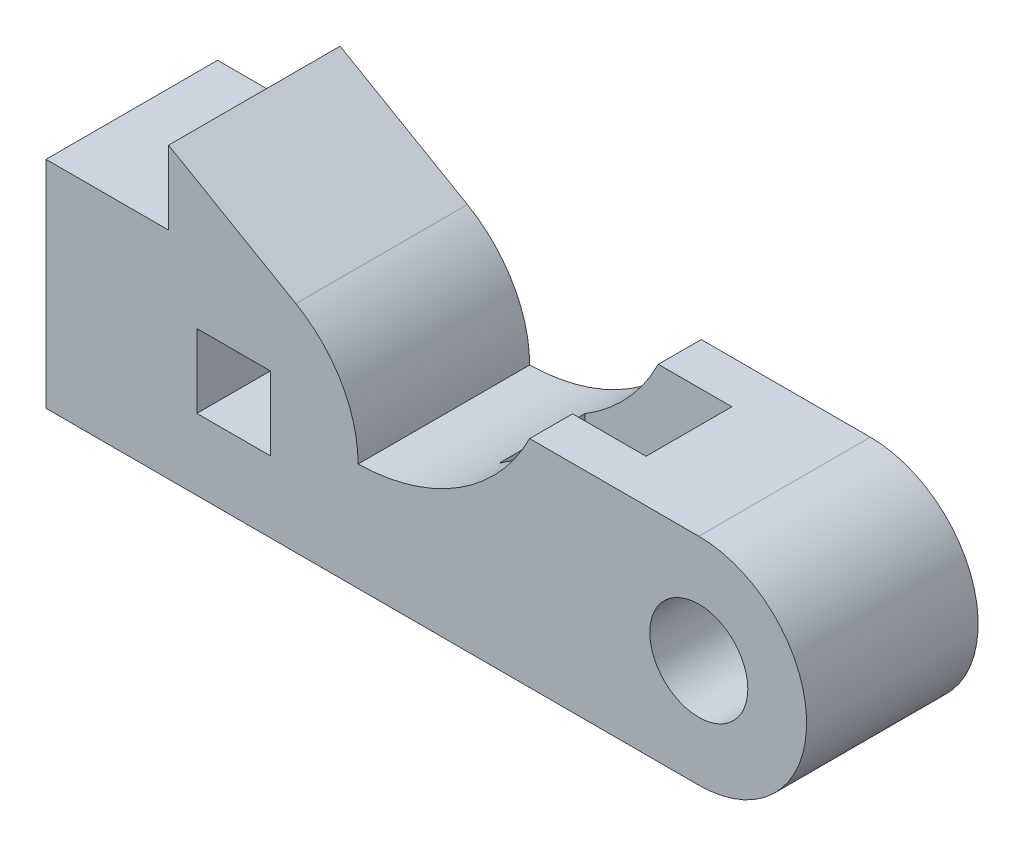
ISO-10303-21;
HEADER;
FILE_DESCRIPTION(('STEP AP214'),'2;1');
FILE_NAME('part.step','',(''),(''),'','','');
FILE_SCHEMA(('AUTOMOTIVE_DESIGN { 1 0 10303 214 1 1 1 1 }'));
ENDSEC;
DATA;
#1=APPLICATION_CONTEXT('core data for automotive mechanical design processes');
#2=APPLICATION_PROTOCOL_DEFINITION('international standard','automotive_design',2000,#1);
#3=PRODUCT_CONTEXT('',#1,'mechanical');
#4=PRODUCT('Part','Part','',(#3));
#5=PRODUCT_RELATED_PRODUCT_CATEGORY('part','',(#4));
#6=PRODUCT_DEFINITION_FORMATION('','',#4);
#7=PRODUCT_DEFINITION_CONTEXT('part definition',#1,'design');
#8=PRODUCT_DEFINITION('design','',#6,#7);
#9=PRODUCT_DEFINITION_SHAPE('','',#8);
#10=(LENGTH_UNIT() NAMED_UNIT(*) SI_UNIT(.MILLI.,.METRE.));
#11=(NAMED_UNIT(*) PLANE_ANGLE_UNIT() SI_UNIT($,.RADIAN.));
#12=(NAMED_UNIT(*) SI_UNIT($,.STERADIAN.) SOLID_ANGLE_UNIT());
#13=UNCERTAINTY_MEASURE_WITH_UNIT(LENGTH_MEASURE(1.E-05),#10,'distance_accuracy_value','');
#14=(GEOMETRIC_REPRESENTATION_CONTEXT(3) GLOBAL_UNCERTAINTY_ASSIGNED_CONTEXT((#13)) GLOBAL_UNIT_ASSIGNED_CONTEXT((#10,
#11,#12)) REPRESENTATION_CONTEXT('',''));
#15=CARTESIAN_POINT('',(0.,0.,0.));
#16=DIRECTION('',(0.,0.,1.));
#17=DIRECTION('',(1.,0.,0.));
#18=AXIS2_PLACEMENT_3D('',#15,#16,#17);
#19=CARTESIAN_POINT('',(76.5581123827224,44.,35.));
#20=DIRECTION('',(0.,0.,-1.));
#21=DIRECTION('',(-1.,0.,0.));
#22=AXIS2_PLACEMENT_3D('',#19,#20,#21);
#23=PLANE('',#22);
#24=CARTESIAN_POINT('',(266.36493607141,44.,35.));
#25=DIRECTION('',(0.,0.,1.));
#26=DIRECTION('',(1.,0.,0.));
#27=AXIS2_PLACEMENT_3D('',#24,#25,#26);
#28=CIRCLE('',#27,20.);
#29=CARTESIAN_POINT('',(286.36493607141,44.,35.));
#30=VERTEX_POINT('',#29);
#31=EDGE_CURVE('E463',#30,#30,#28,.T.);
#32=ORIENTED_EDGE('',*,*,#31,.F.);
#33=EDGE_LOOP('',(#32));
#34=FACE_BOUND('',#33,.T.);
#35=DIRECTION('',(1.,0.,0.));
#36=VECTOR('',#35,1.);
#37=CARTESIAN_POINT('',(266.36493607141,0.,35.));
#38=LINE('',#37,#36);
#39=CARTESIAN_POINT('',(0.,0.,35.));
#40=VERTEX_POINT('',#39);
#41=CARTESIAN_POINT('',(266.36493607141,0.,35.));
#42=VERTEX_POINT('',#41);
#43=EDGE_CURVE('E263',#40,#42,#38,.T.);
#44=ORIENTED_EDGE('',*,*,#43,.T.);
#45=CARTESIAN_POINT('',(266.36493607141,44.,35.));
#46=DIRECTION('',(0.,0.,1.));
#47=DIRECTION('',(-1.,0.,0.));
#48=AXIS2_PLACEMENT_3D('',#45,#46,#47);
#49=CIRCLE('',#48,44.);
#50=CARTESIAN_POINT('',(266.36493607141,88.,35.));
#51=VERTEX_POINT('',#50);
#52=EDGE_CURVE('E267',#42,#51,#49,.T.);
#53=ORIENTED_EDGE('',*,*,#52,.T.);
#54=DIRECTION('',(-1.,0.,0.));
#55=VECTOR('',#54,1.);
#56=CARTESIAN_POINT('',(197.36493607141,88.,35.));
#57=LINE('',#56,#55);
#58=CARTESIAN_POINT('',(197.36493607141,88.,35.));
#59=VERTEX_POINT('',#58);
#60=EDGE_CURVE('E271',#51,#59,#57,.T.);
#61=ORIENTED_EDGE('',*,*,#60,.T.);
#62=CARTESIAN_POINT('',(125.916041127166,123.986878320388,35.));
#63=DIRECTION('',(0.,0.,-1.));
#64=DIRECTION('',(1.,0.,0.));
#65=AXIS2_PLACEMENT_3D('',#62,#63,#64);
#66=CIRCLE('',#65,80.);
#67=CARTESIAN_POINT('',(127.36493607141,44.,35.));
#68=VERTEX_POINT('',#67);
#69=EDGE_CURVE('E274',#59,#68,#66,.T.);
#70=ORIENTED_EDGE('',*,*,#69,.T.);
#71=CARTESIAN_POINT('',(76.5581123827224,44.,35.));
#72=DIRECTION('',(0.,0.,1.));
#73=DIRECTION('',(-1.,0.,0.));
#74=AXIS2_PLACEMENT_3D('',#71,#72,#73);
#75=CIRCLE('',#74,50.8068236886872);
#76=CARTESIAN_POINT('',(101.961524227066,88.,35.));
#77=VERTEX_POINT('',#76);
#78=EDGE_CURVE('E277',#68,#77,#75,.T.);
#79=ORIENTED_EDGE('',*,*,#78,.T.);
#80=DIRECTION('',(-0.866025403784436,0.500000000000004,0.));
#81=VECTOR('',#80,1.);
#82=CARTESIAN_POINT('',(50.,118.,35.));
#83=LINE('',#82,#81);
#84=CARTESIAN_POINT('',(50.,118.,35.));
#85=VERTEX_POINT('',#84);
#86=EDGE_CURVE('E280',#77,#85,#83,.T.);
#87=ORIENTED_EDGE('',*,*,#86,.T.);
#88=DIRECTION('',(0.,-1.,0.));
#89=VECTOR('',#88,1.);
#90=CARTESIAN_POINT('',(50.,88.,35.));
#91=LINE('',#90,#89);
#92=CARTESIAN_POINT('',(50.,88.,35.));
#93=VERTEX_POINT('',#92);
#94=EDGE_CURVE('E283',#85,#93,#91,.T.);
#95=ORIENTED_EDGE('',*,*,#94,.T.);
#96=DIRECTION('',(-1.,0.,0.));
#97=VECTOR('',#96,1.);
#98=CARTESIAN_POINT('',(0.,88.,35.));
#99=LINE('',#98,#97);
#100=CARTESIAN_POINT('',(0.,88.,35.));
#101=VERTEX_POINT('',#100);
#102=EDGE_CURVE('E286',#93,#101,#99,.T.);
#103=ORIENTED_EDGE('',*,*,#102,.T.);
#104=DIRECTION('',(0.,-1.,0.));
#105=VECTOR('',#104,1.);
#106=CARTESIAN_POINT('',(0.,0.,35.));
#107=LINE('',#106,#105);
#108=EDGE_CURVE('E289',#101,#40,#107,.T.);
#109=ORIENTED_EDGE('',*,*,#108,.T.);
#110=EDGE_LOOP('',(#44,#53,#61,#70,#79,#87,#95,#103,#109));
#111=FACE_BOUND('',#110,.T.);
#112=DIRECTION('',(0.,-1.,0.));
#113=VECTOR('',#112,1.);
#114=CARTESIAN_POINT('',(61.5581123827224,29.,35.));
#115=LINE('',#114,#113);
#116=CARTESIAN_POINT('',(61.5581123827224,59.,35.));
#117=VERTEX_POINT('',#116);
#118=CARTESIAN_POINT('',(61.5581123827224,29.,35.));
#119=VERTEX_POINT('',#118);
#120=EDGE_CURVE('E220',#117,#119,#115,.T.);
#121=ORIENTED_EDGE('',*,*,#120,.F.);
#122=DIRECTION('',(-1.,0.,0.));
#123=VECTOR('',#122,1.);
#124=CARTESIAN_POINT('',(91.5581123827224,59.,35.));
#125=LINE('',#124,#123);
#126=CARTESIAN_POINT('',(91.5581123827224,59.,35.));
#127=VERTEX_POINT('',#126);
#128=EDGE_CURVE('E231',#127,#117,#125,.T.);
#129=ORIENTED_EDGE('',*,*,#128,.F.);
#130=DIRECTION('',(0.,1.,0.));
#131=VECTOR('',#130,1.);
#132=CARTESIAN_POINT('',(91.5581123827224,29.,35.));
#133=LINE('',#132,#131);
#134=CARTESIAN_POINT('',(91.5581123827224,29.,35.));
#135=VERTEX_POINT('',#134);
#136=EDGE_CURVE('E227',#135,#127,#133,.T.);
#137=ORIENTED_EDGE('',*,*,#136,.F.);
#138=DIRECTION('',(1.,0.,0.));
#139=VECTOR('',#138,1.);
#140=CARTESIAN_POINT('',(91.5581123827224,29.,35.));
#141=LINE('',#140,#139);
#142=EDGE_CURVE('E223',#119,#135,#141,.T.);
#143=ORIENTED_EDGE('',*,*,#142,.F.);
#144=EDGE_LOOP('',(#121,#129,#137,#143));
#145=FACE_BOUND('',#144,.T.);
#146=ADVANCED_FACE('F45',(#34,#111,#145),#23,.F.);
#147=CARTESIAN_POINT('',(76.5581123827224,44.,-35.));
#148=DIRECTION('',(0.,0.,-1.));
#149=DIRECTION('',(-1.,0.,0.));
#150=AXIS2_PLACEMENT_3D('',#147,#148,#149);
#151=PLANE('',#150);
#152=CARTESIAN_POINT('',(266.36493607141,44.,-35.));
#153=DIRECTION('',(0.,0.,1.));
#154=DIRECTION('',(1.,0.,0.));
#155=AXIS2_PLACEMENT_3D('',#152,#153,#154);
#156=CIRCLE('',#155,20.);
#157=CARTESIAN_POINT('',(286.36493607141,44.,-35.));
#158=VERTEX_POINT('',#157);
#159=EDGE_CURVE('E199',#158,#158,#156,.T.);
#160=ORIENTED_EDGE('',*,*,#159,.T.);
#161=EDGE_LOOP('',(#160));
#162=FACE_BOUND('',#161,.T.);
#163=DIRECTION('',(1.,0.,0.));
#164=VECTOR('',#163,1.);
#165=CARTESIAN_POINT('',(266.36493607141,0.,-35.));
#166=LINE('',#165,#164);
#167=CARTESIAN_POINT('',(0.,0.,-35.));
#168=VERTEX_POINT('',#167);
#169=CARTESIAN_POINT('',(266.36493607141,0.,-35.));
#170=VERTEX_POINT('',#169);
#171=EDGE_CURVE('E262',#168,#170,#166,.T.);
#172=ORIENTED_EDGE('',*,*,#171,.F.);
#173=DIRECTION('',(0.,-1.,0.));
#174=VECTOR('',#173,1.);
#175=CARTESIAN_POINT('',(0.,0.,-35.));
#176=LINE('',#175,#174);
#177=CARTESIAN_POINT('',(0.,88.,-35.));
#178=VERTEX_POINT('',#177);
#179=EDGE_CURVE('E268',#178,#168,#176,.T.);
#180=ORIENTED_EDGE('',*,*,#179,.F.);
#181=DIRECTION('',(-1.,0.,0.));
#182=VECTOR('',#181,1.);
#183=CARTESIAN_POINT('',(0.,88.,-35.));
#184=LINE('',#183,#182);
#185=CARTESIAN_POINT('',(50.,88.,-35.));
#186=VERTEX_POINT('',#185);
#187=EDGE_CURVE('E315',#186,#178,#184,.T.);
#188=ORIENTED_EDGE('',*,*,#187,.F.);
#189=DIRECTION('',(0.,-1.,0.));
#190=VECTOR('',#189,1.);
#191=CARTESIAN_POINT('',(50.,88.,-35.));
#192=LINE('',#191,#190);
#193=CARTESIAN_POINT('',(50.,118.,-35.));
#194=VERTEX_POINT('',#193);
#195=EDGE_CURVE('E312',#194,#186,#192,.T.);
#196=ORIENTED_EDGE('',*,*,#195,.F.);
#197=DIRECTION('',(-0.866025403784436,0.500000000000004,0.));
#198=VECTOR('',#197,1.);
#199=CARTESIAN_POINT('',(50.,118.,-35.));
#200=LINE('',#199,#198);
#201=CARTESIAN_POINT('',(101.961524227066,88.,-35.));
#202=VERTEX_POINT('',#201);
#203=EDGE_CURVE('E309',#202,#194,#200,.T.);
#204=ORIENTED_EDGE('',*,*,#203,.F.);
#205=CARTESIAN_POINT('',(76.5581123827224,44.,-35.));
#206=DIRECTION('',(0.,0.,1.));
#207=DIRECTION('',(-1.,0.,0.));
#208=AXIS2_PLACEMENT_3D('',#205,#206,#207);
#209=CIRCLE('',#208,50.8068236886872);
#210=CARTESIAN_POINT('',(127.36493607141,44.,-35.));
#211=VERTEX_POINT('',#210);
#212=EDGE_CURVE('E306',#211,#202,#209,.T.);
#213=ORIENTED_EDGE('',*,*,#212,.F.);
#214=CARTESIAN_POINT('',(125.916041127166,123.986878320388,-35.));
#215=DIRECTION('',(0.,0.,-1.));
#216=DIRECTION('',(1.,0.,0.));
#217=AXIS2_PLACEMENT_3D('',#214,#215,#216);
#218=CIRCLE('',#217,80.);
#219=CARTESIAN_POINT('',(197.36493607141,88.,-35.));
#220=VERTEX_POINT('',#219);
#221=EDGE_CURVE('E303',#220,#211,#218,.T.);
#222=ORIENTED_EDGE('',*,*,#221,.F.);
#223=DIRECTION('',(-1.,0.,0.));
#224=VECTOR('',#223,1.);
#225=CARTESIAN_POINT('',(197.36493607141,88.,-35.));
#226=LINE('',#225,#224);
#227=CARTESIAN_POINT('',(266.36493607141,88.,-35.));
#228=VERTEX_POINT('',#227);
#229=EDGE_CURVE('E299',#228,#220,#226,.T.);
#230=ORIENTED_EDGE('',*,*,#229,.F.);
#231=CARTESIAN_POINT('',(266.36493607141,44.,-35.));
#232=DIRECTION('',(0.,0.,1.));
#233=DIRECTION('',(-1.,0.,0.));
#234=AXIS2_PLACEMENT_3D('',#231,#232,#233);
#235=CIRCLE('',#234,44.);
#236=EDGE_CURVE('E296',#170,#228,#235,.T.);
#237=ORIENTED_EDGE('',*,*,#236,.F.);
#238=EDGE_LOOP('',(#172,#180,#188,#196,#204,#213,#222,#230,#237));
#239=FACE_BOUND('',#238,.T.);
#240=DIRECTION('',(-1.,0.,0.));
#241=VECTOR('',#240,1.);
#242=CARTESIAN_POINT('',(91.5581123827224,59.,-35.));
#243=LINE('',#242,#241);
#244=CARTESIAN_POINT('',(91.5581123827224,59.,-35.));
#245=VERTEX_POINT('',#244);
#246=CARTESIAN_POINT('',(61.5581123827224,59.,-35.));
#247=VERTEX_POINT('',#246);
#248=EDGE_CURVE('E224',#245,#247,#243,.T.);
#249=ORIENTED_EDGE('',*,*,#248,.T.);
#250=DIRECTION('',(0.,-1.,0.));
#251=VECTOR('',#250,1.);
#252=CARTESIAN_POINT('',(61.5581123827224,29.,-35.));
#253=LINE('',#252,#251);
#254=CARTESIAN_POINT('',(61.5581123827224,29.,-35.));
#255=VERTEX_POINT('',#254);
#256=EDGE_CURVE('E213',#247,#255,#253,.T.);
#257=ORIENTED_EDGE('',*,*,#256,.T.);
#258=DIRECTION('',(1.,0.,0.));
#259=VECTOR('',#258,1.);
#260=CARTESIAN_POINT('',(91.5581123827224,29.,-35.));
#261=LINE('',#260,#259);
#262=CARTESIAN_POINT('',(91.5581123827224,29.,-35.));
#263=VERTEX_POINT('',#262);
#264=EDGE_CURVE('E238',#255,#263,#261,.T.);
#265=ORIENTED_EDGE('',*,*,#264,.T.);
#266=DIRECTION('',(0.,1.,0.));
#267=VECTOR('',#266,1.);
#268=CARTESIAN_POINT('',(91.5581123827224,29.,-35.));
#269=LINE('',#268,#267);
#270=EDGE_CURVE('E242',#263,#245,#269,.T.);
#271=ORIENTED_EDGE('',*,*,#270,.T.);
#272=EDGE_LOOP('',(#249,#257,#265,#271));
#273=FACE_BOUND('',#272,.T.);
#274=ADVANCED_FACE('F383',(#162,#239,#273),#151,.T.);
#275=CARTESIAN_POINT('',(266.36493607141,0.,35.));
#276=DIRECTION('',(0.,1.,0.));
#277=DIRECTION('',(0.,0.,1.));
#278=AXIS2_PLACEMENT_3D('',#275,#276,#277);
#279=PLANE('',#278);
#280=DIRECTION('',(1.,0.,0.));
#281=VECTOR('',#280,1.);
#282=CARTESIAN_POINT('',(167.36493607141,0.,17.5));
#283=LINE('',#282,#281);
#284=CARTESIAN_POINT('',(167.36493607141,0.,17.5));
#285=VERTEX_POINT('',#284);
#286=CARTESIAN_POINT('',(227.36493607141,0.,17.5));
#287=VERTEX_POINT('',#286);
#288=EDGE_CURVE('E183',#285,#287,#283,.T.);
#289=ORIENTED_EDGE('',*,*,#288,.T.);
#290=DIRECTION('',(0.,0.,-1.));
#291=VECTOR('',#290,1.);
#292=CARTESIAN_POINT('',(227.36493607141,0.,17.5));
#293=LINE('',#292,#291);
#294=CARTESIAN_POINT('',(227.36493607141,0.,-17.5));
#295=VERTEX_POINT('',#294);
#296=EDGE_CURVE('E177',#287,#295,#293,.T.);
#297=ORIENTED_EDGE('',*,*,#296,.T.);
#298=DIRECTION('',(-1.,0.,0.));
#299=VECTOR('',#298,1.);
#300=CARTESIAN_POINT('',(167.36493607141,0.,-17.5));
#301=LINE('',#300,#299);
#302=CARTESIAN_POINT('',(167.36493607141,0.,-17.5));
#303=VERTEX_POINT('',#302);
#304=EDGE_CURVE('E186',#295,#303,#301,.T.);
#305=ORIENTED_EDGE('',*,*,#304,.T.);
#306=DIRECTION('',(0.,0.,1.));
#307=VECTOR('',#306,1.);
#308=CARTESIAN_POINT('',(167.36493607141,0.,17.5));
#309=LINE('',#308,#307);
#310=EDGE_CURVE('E61',#303,#285,#309,.T.);
#311=ORIENTED_EDGE('',*,*,#310,.T.);
#312=EDGE_LOOP('',(#289,#297,#305,#311));
#313=FACE_BOUND('',#312,.T.);
#314=ORIENTED_EDGE('',*,*,#171,.T.);
#315=DIRECTION('',(0.,0.,-1.));
#316=VECTOR('',#315,1.);
#317=CARTESIAN_POINT('',(266.36493607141,0.,35.));
#318=LINE('',#317,#316);
#319=EDGE_CURVE('E352',#42,#170,#318,.T.);
#320=ORIENTED_EDGE('',*,*,#319,.F.);
#321=ORIENTED_EDGE('',*,*,#43,.F.);
#322=DIRECTION('',(0.,0.,-1.));
#323=VECTOR('',#322,1.);
#324=CARTESIAN_POINT('',(0.,0.,35.));
#325=LINE('',#324,#323);
#326=EDGE_CURVE('E292',#40,#168,#325,.T.);
#327=ORIENTED_EDGE('',*,*,#326,.T.);
#328=EDGE_LOOP('',(#314,#320,#321,#327));
#329=FACE_BOUND('',#328,.T.);
#330=ADVANCED_FACE('F47',(#313,#329),#279,.F.);
#331=CARTESIAN_POINT('',(266.36493607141,44.,35.));
#332=DIRECTION('',(0.,0.,-1.));
#333=DIRECTION('',(-1.,0.,0.));
#334=AXIS2_PLACEMENT_3D('',#331,#332,#333);
#335=CYLINDRICAL_SURFACE('',#334,44.);
#336=ORIENTED_EDGE('',*,*,#236,.T.);
#337=DIRECTION('',(0.,0.,-1.));
#338=VECTOR('',#337,1.);
#339=CARTESIAN_POINT('',(266.36493607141,88.,35.));
#340=LINE('',#339,#338);
#341=EDGE_CURVE('E348',#51,#228,#340,.T.);
#342=ORIENTED_EDGE('',*,*,#341,.F.);
#343=ORIENTED_EDGE('',*,*,#52,.F.);
#344=ORIENTED_EDGE('',*,*,#319,.T.);
#345=EDGE_LOOP('',(#336,#342,#343,#344));
#346=FACE_BOUND('',#345,.T.);
#347=ADVANCED_FACE('F404',(#346),#335,.T.);
#348=CARTESIAN_POINT('',(197.36493607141,88.,35.));
#349=DIRECTION('',(0.,-1.,0.));
#350=DIRECTION('',(0.,0.,-1.));
#351=AXIS2_PLACEMENT_3D('',#348,#349,#350);
#352=PLANE('',#351);
#353=DIRECTION('',(0.,0.,-1.));
#354=VECTOR('',#353,1.);
#355=CARTESIAN_POINT('',(227.36493607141,88.,17.5));
#356=LINE('',#355,#354);
#357=CARTESIAN_POINT('',(227.36493607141,88.,17.5));
#358=VERTEX_POINT('',#357);
#359=CARTESIAN_POINT('',(227.36493607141,88.,-17.5));
#360=VERTEX_POINT('',#359);
#361=EDGE_CURVE('E180',#358,#360,#356,.T.);
#362=ORIENTED_EDGE('',*,*,#361,.F.);
#363=DIRECTION('',(1.,0.,0.));
#364=VECTOR('',#363,1.);
#365=CARTESIAN_POINT('',(167.36493607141,88.,17.5));
#366=LINE('',#365,#364);
#367=CARTESIAN_POINT('',(197.36493607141,88.,17.5));
#368=VERTEX_POINT('',#367);
#369=EDGE_CURVE('E194',#368,#358,#366,.T.);
#370=ORIENTED_EDGE('',*,*,#369,.F.);
#371=DIRECTION('',(0.,0.,-1.));
#372=VECTOR('',#371,1.);
#373=CARTESIAN_POINT('',(197.36493607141,88.,35.));
#374=LINE('',#373,#372);
#375=EDGE_CURVE('E344',#59,#368,#374,.T.);
#376=ORIENTED_EDGE('',*,*,#375,.F.);
#377=ORIENTED_EDGE('',*,*,#60,.F.);
#378=ORIENTED_EDGE('',*,*,#341,.T.);
#379=ORIENTED_EDGE('',*,*,#229,.T.);
#380=CARTESIAN_POINT('',(197.36493607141,88.,-17.5));
#381=VERTEX_POINT('',#380);
#382=EDGE_CURVE('E343',#381,#220,#374,.T.);
#383=ORIENTED_EDGE('',*,*,#382,.F.);
#384=DIRECTION('',(-1.,0.,0.));
#385=VECTOR('',#384,1.);
#386=CARTESIAN_POINT('',(167.36493607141,88.,-17.5));
#387=LINE('',#386,#385);
#388=EDGE_CURVE('E69',#360,#381,#387,.T.);
#389=ORIENTED_EDGE('',*,*,#388,.F.);
#390=EDGE_LOOP('',(#362,#370,#376,#377,#378,#379,#383,#389));
#391=FACE_BOUND('',#390,.T.);
#392=ADVANCED_FACE('F368',(#391),#352,.F.);
#393=CARTESIAN_POINT('',(125.916041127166,123.986878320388,35.));
#394=DIRECTION('',(0.,0.,-1.));
#395=DIRECTION('',(-1.,0.,0.));
#396=AXIS2_PLACEMENT_3D('',#393,#394,#395);
#397=CYLINDRICAL_SURFACE('',#396,80.);
#398=ORIENTED_EDGE('',*,*,#375,.T.);
#399=CARTESIAN_POINT('',(125.916041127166,123.986878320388,17.5));
#400=DIRECTION('',(0.,0.,1.));
#401=DIRECTION('',(1.,0.,0.));
#402=AXIS2_PLACEMENT_3D('',#399,#400,#401);
#403=CIRCLE('',#402,80.);
#404=CARTESIAN_POINT('',(167.36493607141,55.5618163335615,17.5));
#405=VERTEX_POINT('',#404);
#406=EDGE_CURVE('E11',#368,#405,#403,.F.);
#407=ORIENTED_EDGE('',*,*,#406,.T.);
#408=DIRECTION('',(0.,0.,-1.));
#409=VECTOR('',#408,1.);
#410=CARTESIAN_POINT('',(167.36493607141,55.5618163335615,35.));
#411=LINE('',#410,#409);
#412=CARTESIAN_POINT('',(167.36493607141,55.5618163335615,-17.5));
#413=VERTEX_POINT('',#412);
#414=EDGE_CURVE('E54',#405,#413,#411,.T.);
#415=ORIENTED_EDGE('',*,*,#414,.T.);
#416=CARTESIAN_POINT('',(125.916041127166,123.986878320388,-17.5));
#417=DIRECTION('',(0.,0.,-1.));
#418=DIRECTION('',(-1.,0.,0.));
#419=AXIS2_PLACEMENT_3D('',#416,#417,#418);
#420=CIRCLE('',#419,80.);
#421=EDGE_CURVE('E356',#413,#381,#420,.F.);
#422=ORIENTED_EDGE('',*,*,#421,.T.);
#423=ORIENTED_EDGE('',*,*,#382,.T.);
#424=ORIENTED_EDGE('',*,*,#221,.T.);
#425=DIRECTION('',(0.,0.,-1.));
#426=VECTOR('',#425,1.);
#427=CARTESIAN_POINT('',(127.36493607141,44.,35.));
#428=LINE('',#427,#426);
#429=EDGE_CURVE('E339',#68,#211,#428,.T.);
#430=ORIENTED_EDGE('',*,*,#429,.F.);
#431=ORIENTED_EDGE('',*,*,#69,.F.);
#432=EDGE_LOOP('',(#398,#407,#415,#422,#423,#424,#430,#431));
#433=FACE_BOUND('',#432,.T.);
#434=ADVANCED_FACE('F361',(#433),#397,.F.);
#435=CARTESIAN_POINT('',(76.5581123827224,44.,35.));
#436=DIRECTION('',(0.,0.,-1.));
#437=DIRECTION('',(-1.,0.,0.));
#438=AXIS2_PLACEMENT_3D('',#435,#436,#437);
#439=CYLINDRICAL_SURFACE('',#438,50.8068236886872);
#440=ORIENTED_EDGE('',*,*,#212,.T.);
#441=DIRECTION('',(0.,0.,-1.));
#442=VECTOR('',#441,1.);
#443=CARTESIAN_POINT('',(101.961524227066,88.,35.));
#444=LINE('',#443,#442);
#445=EDGE_CURVE('E335',#77,#202,#444,.T.);
#446=ORIENTED_EDGE('',*,*,#445,.F.);
#447=ORIENTED_EDGE('',*,*,#78,.F.);
#448=ORIENTED_EDGE('',*,*,#429,.T.);
#449=EDGE_LOOP('',(#440,#446,#447,#448));
#450=FACE_BOUND('',#449,.T.);
#451=ADVANCED_FACE('F379',(#450),#439,.T.);
#452=CARTESIAN_POINT('',(50.,118.,35.));
#453=DIRECTION('',(-0.500000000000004,-0.866025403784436,0.));
#454=DIRECTION('',(0.866025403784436,-0.500000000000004,0.));
#455=AXIS2_PLACEMENT_3D('',#452,#453,#454);
#456=PLANE('',#455);
#457=ORIENTED_EDGE('',*,*,#203,.T.);
#458=DIRECTION('',(0.,0.,-1.));
#459=VECTOR('',#458,1.);
#460=CARTESIAN_POINT('',(50.,118.,35.));
#461=LINE('',#460,#459);
#462=EDGE_CURVE('E331',#85,#194,#461,.T.);
#463=ORIENTED_EDGE('',*,*,#462,.F.);
#464=ORIENTED_EDGE('',*,*,#86,.F.);
#465=ORIENTED_EDGE('',*,*,#445,.T.);
#466=EDGE_LOOP('',(#457,#463,#464,#465));
#467=FACE_BOUND('',#466,.T.);
#468=ADVANCED_FACE('F389',(#467),#456,.F.);
#469=CARTESIAN_POINT('',(50.,88.,35.));
#470=DIRECTION('',(1.,0.,0.));
#471=DIRECTION('',(0.,0.,-1.));
#472=AXIS2_PLACEMENT_3D('',#469,#470,#471);
#473=PLANE('',#472);
#474=ORIENTED_EDGE('',*,*,#195,.T.);
#475=DIRECTION('',(0.,0.,-1.));
#476=VECTOR('',#475,1.);
#477=CARTESIAN_POINT('',(50.,88.,35.));
#478=LINE('',#477,#476);
#479=EDGE_CURVE('E327',#93,#186,#478,.T.);
#480=ORIENTED_EDGE('',*,*,#479,.F.);
#481=ORIENTED_EDGE('',*,*,#94,.F.);
#482=ORIENTED_EDGE('',*,*,#462,.T.);
#483=EDGE_LOOP('',(#474,#480,#481,#482));
#484=FACE_BOUND('',#483,.T.);
#485=ADVANCED_FACE('F393',(#484),#473,.F.);
#486=CARTESIAN_POINT('',(0.,88.,35.));
#487=DIRECTION('',(0.,-1.,0.));
#488=DIRECTION('',(0.,0.,-1.));
#489=AXIS2_PLACEMENT_3D('',#486,#487,#488);
#490=PLANE('',#489);
#491=ORIENTED_EDGE('',*,*,#187,.T.);
#492=DIRECTION('',(0.,0.,-1.));
#493=VECTOR('',#492,1.);
#494=CARTESIAN_POINT('',(0.,88.,35.));
#495=LINE('',#494,#493);
#496=EDGE_CURVE('E323',#101,#178,#495,.T.);
#497=ORIENTED_EDGE('',*,*,#496,.F.);
#498=ORIENTED_EDGE('',*,*,#102,.F.);
#499=ORIENTED_EDGE('',*,*,#479,.T.);
#500=EDGE_LOOP('',(#491,#497,#498,#499));
#501=FACE_BOUND('',#500,.T.);
#502=ADVANCED_FACE('F411',(#501),#490,.F.);
#503=CARTESIAN_POINT('',(0.,0.,35.));
#504=DIRECTION('',(1.,0.,0.));
#505=DIRECTION('',(0.,0.,-1.));
#506=AXIS2_PLACEMENT_3D('',#503,#504,#505);
#507=PLANE('',#506);
#508=ORIENTED_EDGE('',*,*,#179,.T.);
#509=ORIENTED_EDGE('',*,*,#326,.F.);
#510=ORIENTED_EDGE('',*,*,#108,.F.);
#511=ORIENTED_EDGE('',*,*,#496,.T.);
#512=EDGE_LOOP('',(#508,#509,#510,#511));
#513=FACE_BOUND('',#512,.T.);
#514=ADVANCED_FACE('F409',(#513),#507,.F.);
#515=CARTESIAN_POINT('',(61.5581123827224,29.,35.));
#516=DIRECTION('',(1.,0.,0.));
#517=DIRECTION('',(0.,0.,-1.));
#518=AXIS2_PLACEMENT_3D('',#515,#516,#517);
#519=PLANE('',#518);
#520=ORIENTED_EDGE('',*,*,#256,.F.);
#521=DIRECTION('',(0.,0.,-1.));
#522=VECTOR('',#521,1.);
#523=CARTESIAN_POINT('',(61.5581123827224,59.,35.));
#524=LINE('',#523,#522);
#525=EDGE_CURVE('E234',#117,#247,#524,.T.);
#526=ORIENTED_EDGE('',*,*,#525,.F.);
#527=ORIENTED_EDGE('',*,*,#120,.T.);
#528=DIRECTION('',(0.,0.,-1.));
#529=VECTOR('',#528,1.);
#530=CARTESIAN_POINT('',(61.5581123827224,29.,35.));
#531=LINE('',#530,#529);
#532=EDGE_CURVE('E258',#119,#255,#531,.T.);
#533=ORIENTED_EDGE('',*,*,#532,.T.);
#534=EDGE_LOOP('',(#520,#526,#527,#533));
#535=FACE_BOUND('',#534,.T.);
#536=ADVANCED_FACE('F418',(#535),#519,.T.);
#537=CARTESIAN_POINT('',(91.5581123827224,29.,35.));
#538=DIRECTION('',(0.,1.,0.));
#539=DIRECTION('',(0.,0.,1.));
#540=AXIS2_PLACEMENT_3D('',#537,#538,#539);
#541=PLANE('',#540);
#542=ORIENTED_EDGE('',*,*,#264,.F.);
#543=ORIENTED_EDGE('',*,*,#532,.F.);
#544=ORIENTED_EDGE('',*,*,#142,.T.);
#545=DIRECTION('',(0.,0.,-1.));
#546=VECTOR('',#545,1.);
#547=CARTESIAN_POINT('',(91.5581123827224,29.,35.));
#548=LINE('',#547,#546);
#549=EDGE_CURVE('E255',#135,#263,#548,.T.);
#550=ORIENTED_EDGE('',*,*,#549,.T.);
#551=EDGE_LOOP('',(#542,#543,#544,#550));
#552=FACE_BOUND('',#551,.T.);
#553=ADVANCED_FACE('F434',(#552),#541,.T.);
#554=CARTESIAN_POINT('',(91.5581123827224,29.,35.));
#555=DIRECTION('',(-1.,0.,0.));
#556=DIRECTION('',(0.,0.,1.));
#557=AXIS2_PLACEMENT_3D('',#554,#555,#556);
#558=PLANE('',#557);
#559=ORIENTED_EDGE('',*,*,#270,.F.);
#560=ORIENTED_EDGE('',*,*,#549,.F.);
#561=ORIENTED_EDGE('',*,*,#136,.T.);
#562=DIRECTION('',(0.,0.,-1.));
#563=VECTOR('',#562,1.);
#564=CARTESIAN_POINT('',(91.5581123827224,59.,35.));
#565=LINE('',#564,#563);
#566=EDGE_CURVE('E252',#127,#245,#565,.T.);
#567=ORIENTED_EDGE('',*,*,#566,.T.);
#568=EDGE_LOOP('',(#559,#560,#561,#567));
#569=FACE_BOUND('',#568,.T.);
#570=ADVANCED_FACE('F438',(#569),#558,.T.);
#571=CARTESIAN_POINT('',(91.5581123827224,59.,35.));
#572=DIRECTION('',(0.,-1.,0.));
#573=DIRECTION('',(0.,0.,-1.));
#574=AXIS2_PLACEMENT_3D('',#571,#572,#573);
#575=PLANE('',#574);
#576=ORIENTED_EDGE('',*,*,#248,.F.);
#577=ORIENTED_EDGE('',*,*,#566,.F.);
#578=ORIENTED_EDGE('',*,*,#128,.T.);
#579=ORIENTED_EDGE('',*,*,#525,.T.);
#580=EDGE_LOOP('',(#576,#577,#578,#579));
#581=FACE_BOUND('',#580,.T.);
#582=ADVANCED_FACE('F442',(#581),#575,.T.);
#583=CARTESIAN_POINT('',(167.36493607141,0.,17.5));
#584=DIRECTION('',(0.,0.,1.));
#585=DIRECTION('',(1.,0.,0.));
#586=AXIS2_PLACEMENT_3D('',#583,#584,#585);
#587=PLANE('',#586);
#588=ORIENTED_EDGE('',*,*,#369,.T.);
#589=DIRECTION('',(0.,1.,0.));
#590=VECTOR('',#589,1.);
#591=CARTESIAN_POINT('',(227.36493607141,0.,17.5));
#592=LINE('',#591,#590);
#593=EDGE_CURVE('E210',#287,#358,#592,.T.);
#594=ORIENTED_EDGE('',*,*,#593,.F.);
#595=ORIENTED_EDGE('',*,*,#288,.F.);
#596=DIRECTION('',(0.,1.,0.));
#597=VECTOR('',#596,1.);
#598=CARTESIAN_POINT('',(167.36493607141,0.,17.5));
#599=LINE('',#598,#597);
#600=EDGE_CURVE('E214',#285,#405,#599,.T.);
#601=ORIENTED_EDGE('',*,*,#600,.T.);
#602=ORIENTED_EDGE('',*,*,#406,.F.);
#603=EDGE_LOOP('',(#588,#594,#595,#601,#602));
#604=FACE_BOUND('',#603,.T.);
#605=ADVANCED_FACE('F365',(#604),#587,.F.);
#606=CARTESIAN_POINT('',(167.36493607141,0.,17.5));
#607=DIRECTION('',(-1.,0.,0.));
#608=DIRECTION('',(0.,-1.,0.));
#609=AXIS2_PLACEMENT_3D('',#606,#607,#608);
#610=PLANE('',#609);
#611=ORIENTED_EDGE('',*,*,#600,.F.);
#612=ORIENTED_EDGE('',*,*,#310,.F.);
#613=DIRECTION('',(0.,1.,0.));
#614=VECTOR('',#613,1.);
#615=CARTESIAN_POINT('',(167.36493607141,0.,-17.5));
#616=LINE('',#615,#614);
#617=EDGE_CURVE('E182',#303,#413,#616,.T.);
#618=ORIENTED_EDGE('',*,*,#617,.T.);
#619=ORIENTED_EDGE('',*,*,#414,.F.);
#620=EDGE_LOOP('',(#611,#612,#618,#619));
#621=FACE_BOUND('',#620,.T.);
#622=ADVANCED_FACE('F363',(#621),#610,.F.);
#623=CARTESIAN_POINT('',(167.36493607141,0.,-17.5));
#624=DIRECTION('',(0.,0.,-1.));
#625=DIRECTION('',(-1.,0.,0.));
#626=AXIS2_PLACEMENT_3D('',#623,#624,#625);
#627=PLANE('',#626);
#628=ORIENTED_EDGE('',*,*,#617,.F.);
#629=ORIENTED_EDGE('',*,*,#304,.F.);
#630=DIRECTION('',(0.,1.,0.));
#631=VECTOR('',#630,1.);
#632=CARTESIAN_POINT('',(227.36493607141,0.,-17.5));
#633=LINE('',#632,#631);
#634=EDGE_CURVE('E172',#295,#360,#633,.T.);
#635=ORIENTED_EDGE('',*,*,#634,.T.);
#636=ORIENTED_EDGE('',*,*,#388,.T.);
#637=ORIENTED_EDGE('',*,*,#421,.F.);
#638=EDGE_LOOP('',(#628,#629,#635,#636,#637));
#639=FACE_BOUND('',#638,.T.);
#640=ADVANCED_FACE('F187',(#639),#627,.F.);
#641=CARTESIAN_POINT('',(227.36493607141,0.,17.5));
#642=DIRECTION('',(1.,0.,0.));
#643=DIRECTION('',(0.,1.,0.));
#644=AXIS2_PLACEMENT_3D('',#641,#642,#643);
#645=PLANE('',#644);
#646=ORIENTED_EDGE('',*,*,#361,.T.);
#647=ORIENTED_EDGE('',*,*,#634,.F.);
#648=ORIENTED_EDGE('',*,*,#296,.F.);
#649=ORIENTED_EDGE('',*,*,#593,.T.);
#650=EDGE_LOOP('',(#646,#647,#648,#649));
#651=FACE_BOUND('',#650,.T.);
#652=ADVANCED_FACE('F174',(#651),#645,.F.);
#653=CARTESIAN_POINT('',(266.36493607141,44.,-35.));
#654=DIRECTION('',(0.,0.,1.));
#655=DIRECTION('',(1.,0.,0.));
#656=AXIS2_PLACEMENT_3D('',#653,#654,#655);
#657=CYLINDRICAL_SURFACE('',#656,20.);
#658=ORIENTED_EDGE('',*,*,#159,.F.);
#659=EDGE_LOOP('',(#658));
#660=FACE_BOUND('',#659,.T.);
#661=ORIENTED_EDGE('',*,*,#31,.T.);
#662=EDGE_LOOP('',(#661));
#663=FACE_BOUND('',#662,.T.);
#664=ADVANCED_FACE('F448',(#660,#663),#657,.F.);
#665=CLOSED_SHELL('',(#146,#274,#330,#347,#392,#434,#451,#468,#485,#502,#514,#536,#553,#570,
#582,#605,#622,#640,#652,#664));
#666=MANIFOLD_SOLID_BREP('B2',#665);
#667=ADVANCED_BREP_SHAPE_REPRESENTATION('',(#18,#666),#14);
#668=SHAPE_DEFINITION_REPRESENTATION(#9,#667);
ENDSEC;
END-ISO-10303-21;
